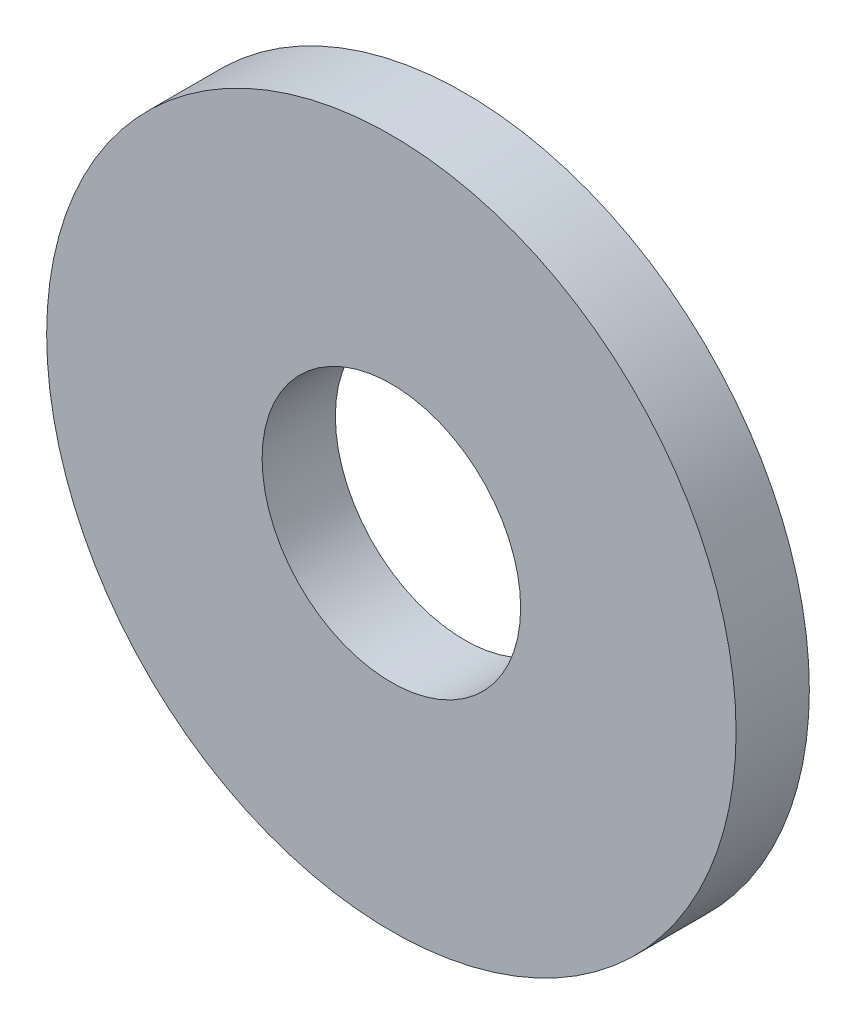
ISO-10303-21;
HEADER;
FILE_DESCRIPTION(('STEP AP214'),'2;1');
FILE_NAME('part.step','',(''),(''),'','','');
FILE_SCHEMA(('AUTOMOTIVE_DESIGN { 1 0 10303 214 1 1 1 1 }'));
ENDSEC;
DATA;
#1=APPLICATION_CONTEXT('core data for automotive mechanical design processes');
#2=APPLICATION_PROTOCOL_DEFINITION('international standard','automotive_design',2000,#1);
#3=PRODUCT_CONTEXT('',#1,'mechanical');
#4=PRODUCT('Part','Part','',(#3));
#5=PRODUCT_RELATED_PRODUCT_CATEGORY('part','',(#4));
#6=PRODUCT_DEFINITION_FORMATION('','',#4);
#7=PRODUCT_DEFINITION_CONTEXT('part definition',#1,'design');
#8=PRODUCT_DEFINITION('design','',#6,#7);
#9=PRODUCT_DEFINITION_SHAPE('','',#8);
#10=(LENGTH_UNIT() NAMED_UNIT(*) SI_UNIT(.MILLI.,.METRE.));
#11=(NAMED_UNIT(*) PLANE_ANGLE_UNIT() SI_UNIT($,.RADIAN.));
#12=(NAMED_UNIT(*) SI_UNIT($,.STERADIAN.) SOLID_ANGLE_UNIT());
#13=UNCERTAINTY_MEASURE_WITH_UNIT(LENGTH_MEASURE(1.E-05),#10,'distance_accuracy_value','');
#14=(GEOMETRIC_REPRESENTATION_CONTEXT(3) GLOBAL_UNCERTAINTY_ASSIGNED_CONTEXT((#13)) GLOBAL_UNIT_ASSIGNED_CONTEXT((#10,
#11,#12)) REPRESENTATION_CONTEXT('',''));
#15=CARTESIAN_POINT('',(0.,0.,0.));
#16=DIRECTION('',(0.,0.,1.));
#17=DIRECTION('',(1.,0.,0.));
#18=AXIS2_PLACEMENT_3D('',#15,#16,#17);
#19=CARTESIAN_POINT('',(0.,0.,0.85));
#20=DIRECTION('',(0.,0.,1.));
#21=DIRECTION('',(1.,0.,0.));
#22=AXIS2_PLACEMENT_3D('',#19,#20,#21);
#23=PLANE('',#22);
#24=CARTESIAN_POINT('',(0.,0.,0.85));
#25=DIRECTION('',(0.,0.,1.));
#26=DIRECTION('',(1.,0.,0.));
#27=AXIS2_PLACEMENT_3D('',#24,#25,#26);
#28=CIRCLE('',#27,4.);
#29=CARTESIAN_POINT('',(4.,0.,0.85));
#30=VERTEX_POINT('',#29);
#31=EDGE_CURVE('E10',#30,#30,#28,.T.);
#32=ORIENTED_EDGE('',*,*,#31,.T.);
#33=EDGE_LOOP('',(#32));
#34=FACE_BOUND('',#33,.T.);
#35=CARTESIAN_POINT('',(0.,0.,0.85));
#36=DIRECTION('',(0.,0.,1.));
#37=DIRECTION('',(1.,0.,0.));
#38=AXIS2_PLACEMENT_3D('',#35,#36,#37);
#39=CIRCLE('',#38,1.5);
#40=CARTESIAN_POINT('',(1.5,0.,0.85));
#41=VERTEX_POINT('',#40);
#42=EDGE_CURVE('E41',#41,#41,#39,.T.);
#43=ORIENTED_EDGE('',*,*,#42,.F.);
#44=EDGE_LOOP('',(#43));
#45=FACE_BOUND('',#44,.T.);
#46=ADVANCED_FACE('F30',(#34,#45),#23,.T.);
#47=CARTESIAN_POINT('',(0.,0.,0.));
#48=DIRECTION('',(0.,0.,1.));
#49=DIRECTION('',(1.,0.,0.));
#50=AXIS2_PLACEMENT_3D('',#47,#48,#49);
#51=PLANE('',#50);
#52=CARTESIAN_POINT('',(0.,0.,0.));
#53=DIRECTION('',(0.,0.,1.));
#54=DIRECTION('',(1.,0.,0.));
#55=AXIS2_PLACEMENT_3D('',#52,#53,#54);
#56=CIRCLE('',#55,4.);
#57=CARTESIAN_POINT('',(4.,0.,0.));
#58=VERTEX_POINT('',#57);
#59=EDGE_CURVE('E37',#58,#58,#56,.T.);
#60=ORIENTED_EDGE('',*,*,#59,.F.);
#61=EDGE_LOOP('',(#60));
#62=FACE_BOUND('',#61,.T.);
#63=CARTESIAN_POINT('',(0.,0.,0.));
#64=DIRECTION('',(0.,0.,1.));
#65=DIRECTION('',(1.,0.,0.));
#66=AXIS2_PLACEMENT_3D('',#63,#64,#65);
#67=CIRCLE('',#66,1.5);
#68=CARTESIAN_POINT('',(1.5,0.,0.));
#69=VERTEX_POINT('',#68);
#70=EDGE_CURVE('E45',#69,#69,#67,.T.);
#71=ORIENTED_EDGE('',*,*,#70,.T.);
#72=EDGE_LOOP('',(#71));
#73=FACE_BOUND('',#72,.T.);
#74=ADVANCED_FACE('F51',(#62,#73),#51,.F.);
#75=CARTESIAN_POINT('',(0.,0.,0.85));
#76=DIRECTION('',(0.,0.,-1.));
#77=DIRECTION('',(-1.,0.,0.));
#78=AXIS2_PLACEMENT_3D('',#75,#76,#77);
#79=CYLINDRICAL_SURFACE('',#78,4.);
#80=ORIENTED_EDGE('',*,*,#31,.F.);
#81=EDGE_LOOP('',(#80));
#82=FACE_BOUND('',#81,.T.);
#83=ORIENTED_EDGE('',*,*,#59,.T.);
#84=EDGE_LOOP('',(#83));
#85=FACE_BOUND('',#84,.T.);
#86=ADVANCED_FACE('F32',(#82,#85),#79,.T.);
#87=CARTESIAN_POINT('',(0.,0.,0.85));
#88=DIRECTION('',(0.,0.,-1.));
#89=DIRECTION('',(-1.,0.,0.));
#90=AXIS2_PLACEMENT_3D('',#87,#88,#89);
#91=CYLINDRICAL_SURFACE('',#90,1.5);
#92=ORIENTED_EDGE('',*,*,#42,.T.);
#93=EDGE_LOOP('',(#92));
#94=FACE_BOUND('',#93,.T.);
#95=ORIENTED_EDGE('',*,*,#70,.F.);
#96=EDGE_LOOP('',(#95));
#97=FACE_BOUND('',#96,.T.);
#98=ADVANCED_FACE('F53',(#94,#97),#91,.F.);
#99=CLOSED_SHELL('',(#46,#74,#86,#98));
#100=MANIFOLD_SOLID_BREP('B2',#99);
#101=ADVANCED_BREP_SHAPE_REPRESENTATION('',(#18,#100),#14);
#102=SHAPE_DEFINITION_REPRESENTATION(#9,#101);
ENDSEC;
END-ISO-10303-21;
